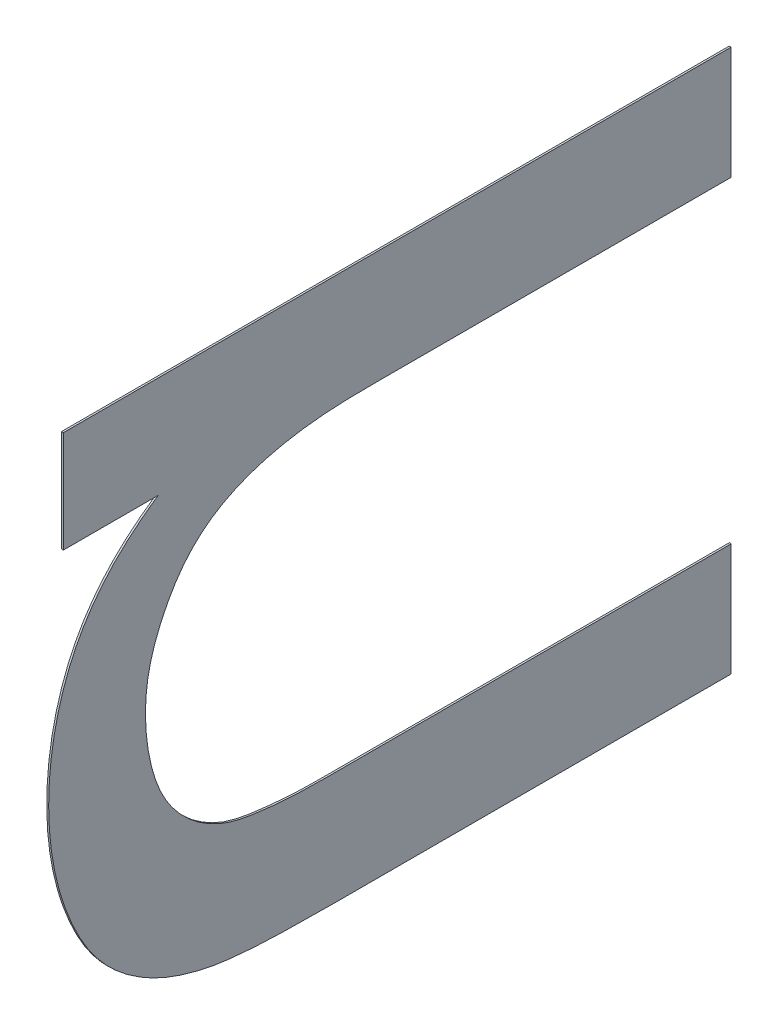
ISO-10303-21;
HEADER;
FILE_DESCRIPTION(('STEP AP214'),'2;1');
FILE_NAME('part.step','',(''),(''),'','','');
FILE_SCHEMA(('AUTOMOTIVE_DESIGN { 1 0 10303 214 1 1 1 1 }'));
ENDSEC;
DATA;
#1=APPLICATION_CONTEXT('core data for automotive mechanical design processes');
#2=APPLICATION_PROTOCOL_DEFINITION('international standard','automotive_design',2000,#1);
#3=PRODUCT_CONTEXT('',#1,'mechanical');
#4=PRODUCT('Part','Part','',(#3));
#5=PRODUCT_RELATED_PRODUCT_CATEGORY('part','',(#4));
#6=PRODUCT_DEFINITION_FORMATION('','',#4);
#7=PRODUCT_DEFINITION_CONTEXT('part definition',#1,'design');
#8=PRODUCT_DEFINITION('design','',#6,#7);
#9=PRODUCT_DEFINITION_SHAPE('','',#8);
#10=(LENGTH_UNIT() NAMED_UNIT(*) SI_UNIT(.MILLI.,.METRE.));
#11=(NAMED_UNIT(*) PLANE_ANGLE_UNIT() SI_UNIT($,.RADIAN.));
#12=(NAMED_UNIT(*) SI_UNIT($,.STERADIAN.) SOLID_ANGLE_UNIT());
#13=UNCERTAINTY_MEASURE_WITH_UNIT(LENGTH_MEASURE(1.E-05),#10,'distance_accuracy_value','');
#14=(GEOMETRIC_REPRESENTATION_CONTEXT(3) GLOBAL_UNCERTAINTY_ASSIGNED_CONTEXT((#13)) GLOBAL_UNIT_ASSIGNED_CONTEXT((#10,
#11,#12)) REPRESENTATION_CONTEXT('',''));
#15=CARTESIAN_POINT('',(0.,0.,0.));
#16=DIRECTION('',(0.,0.,1.));
#17=DIRECTION('',(1.,0.,0.));
#18=AXIS2_PLACEMENT_3D('',#15,#16,#17);
#19=CARTESIAN_POINT('',(-5.56,-14.45127010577,20.008744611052));
#20=DIRECTION('',(-1.,0.,0.));
#21=DIRECTION('',(0.,-1.,0.));
#22=AXIS2_PLACEMENT_3D('',#19,#20,#21);
#23=PLANE('',#22);
#24=DIRECTION('',(0.,1.,0.));
#25=VECTOR('',#24,1.);
#26=CARTESIAN_POINT('',(-5.56,-11.65675241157,20.699035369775));
#27=LINE('',#26,#25);
#28=CARTESIAN_POINT('',(-5.56,-11.65675241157,20.699035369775));
#29=VERTEX_POINT('',#28);
#30=CARTESIAN_POINT('',(-5.56,-12.19051446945,20.699035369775));
#31=VERTEX_POINT('',#30);
#32=EDGE_CURVE('E114',#29,#31,#27,.F.);
#33=ORIENTED_EDGE('',*,*,#32,.F.);
#34=DIRECTION('',(0.,0.,1.));
#35=VECTOR('',#34,1.);
#36=CARTESIAN_POINT('',(-5.56,-11.65675241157,17.19421221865));
#37=LINE('',#36,#35);
#38=CARTESIAN_POINT('',(-5.56,-11.65675241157,17.19421221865));
#39=VERTEX_POINT('',#38);
#40=EDGE_CURVE('E108',#39,#29,#37,.T.);
#41=ORIENTED_EDGE('',*,*,#40,.F.);
#42=DIRECTION('',(0.,-1.,0.));
#43=VECTOR('',#42,1.);
#44=CARTESIAN_POINT('',(-5.56,-14.45127010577,17.19421221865));
#45=LINE('',#44,#43);
#46=CARTESIAN_POINT('',(-5.56,-12.24839228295,17.19421221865));
#47=VERTEX_POINT('',#46);
#48=EDGE_CURVE('E96',#39,#47,#45,.T.);
#49=ORIENTED_EDGE('',*,*,#48,.T.);
#50=CARTESIAN_POINT('',(-5.56,-13.91398713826,17.19421221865));
#51=CARTESIAN_POINT('',(-5.56,-13.9139871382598,17.2008788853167));
#52=CARTESIAN_POINT('',(-5.56,-13.9139871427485,17.2075455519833));
#53=CARTESIAN_POINT('',(-5.56,-13.9139871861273,17.2408788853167));
#54=CARTESIAN_POINT('',(-5.56,-13.9139872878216,17.2675455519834));
#55=CARTESIAN_POINT('',(-5.56,-13.9139877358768,17.3475455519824));
#56=CARTESIAN_POINT('',(-5.56,-13.9139882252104,17.4008788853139));
#57=CARTESIAN_POINT('',(-5.56,-13.9139890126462,17.4808788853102));
#58=CARTESIAN_POINT('',(-5.56,-13.9139892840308,17.5075455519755));
#59=CARTESIAN_POINT('',(-5.56,-13.91398980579,17.5608788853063));
#60=CARTESIAN_POINT('',(-5.56,-13.9139900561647,17.5875455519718));
#61=CARTESIAN_POINT('',(-5.56,-13.9139904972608,17.6408788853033));
#62=CARTESIAN_POINT('',(-5.56,-13.9139906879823,17.6675455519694));
#63=CARTESIAN_POINT('',(-5.56,-13.9139909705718,17.7208788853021));
#64=CARTESIAN_POINT('',(-5.56,-13.9139910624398,17.7475455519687));
#65=CARTESIAN_POINT('',(-5.56,-13.9139911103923,17.8008788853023));
#66=CARTESIAN_POINT('',(-5.56,-13.9139910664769,17.8275455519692));
#67=CARTESIAN_POINT('',(-5.56,-13.9139907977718,17.8808788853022));
#68=CARTESIAN_POINT('',(-5.56,-13.9139905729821,17.9075455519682));
#69=CARTESIAN_POINT('',(-5.56,-13.9139899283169,17.9608788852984));
#70=CARTESIAN_POINT('',(-5.56,-13.9139895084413,17.9875455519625));
#71=CARTESIAN_POINT('',(-5.56,-13.9139877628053,18.0675455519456));
#72=CARTESIAN_POINT('',(-5.56,-13.9139859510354,18.1208788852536));
#73=CARTESIAN_POINT('',(-5.56,-13.9139832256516,18.2008788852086));
#74=CARTESIAN_POINT('',(-5.56,-13.9139823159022,18.2275455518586));
#75=CARTESIAN_POINT('',(-5.56,-13.9139801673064,18.3075455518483));
#76=CARTESIAN_POINT('',(-5.56,-13.9139795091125,18.3608788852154));
#77=CARTESIAN_POINT('',(-5.56,-13.9139813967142,18.4408788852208));
#78=CARTESIAN_POINT('',(-5.56,-13.9139825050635,18.4675455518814));
#79=CARTESIAN_POINT('',(-5.56,-13.9139861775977,18.5208788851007));
#80=CARTESIAN_POINT('',(-5.56,-13.9139887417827,18.5475455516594));
#81=CARTESIAN_POINT('',(-5.56,-13.9139976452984,18.6275455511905));
#82=CARTESIAN_POINT('',(-5.56,-13.91400519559,18.6808788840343));
#83=CARTESIAN_POINT('',(-5.56,-13.9140113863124,18.7608788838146));
#84=CARTESIAN_POINT('',(-5.56,-13.9140125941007,18.7875455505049));
#85=CARTESIAN_POINT('',(-5.56,-13.9140111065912,18.8675455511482));
#86=CARTESIAN_POINT('',(-5.56,-13.914003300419,18.9208788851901));
#87=CARTESIAN_POINT('',(-5.56,-13.9139794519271,19.0008788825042));
#88=CARTESIAN_POINT('',(-5.56,-13.9139694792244,19.027545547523));
#89=CARTESIAN_POINT('',(-5.56,-13.9139495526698,19.0808788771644));
#90=CARTESIAN_POINT('',(-5.56,-13.9139395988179,19.1075455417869));
#91=CARTESIAN_POINT('',(-5.56,-13.9139766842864,19.1875455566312));
#92=CARTESIAN_POINT('',(-5.56,-13.9140906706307,19.2408789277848));
#93=CARTESIAN_POINT('',(-5.56,-13.9139790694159,19.320879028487));
#94=CARTESIAN_POINT('',(-5.56,-13.9138947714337,19.3475458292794));
#95=CARTESIAN_POINT('',(-5.56,-13.9132873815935,19.4008942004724));
#96=CARTESIAN_POINT('',(-5.56,-13.9127640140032,19.4275757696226));
#97=CARTESIAN_POINT('',(-5.56,-13.9107964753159,19.4809003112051));
#98=CARTESIAN_POINT('',(-5.56,-13.9093525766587,19.5075432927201));
#99=CARTESIAN_POINT('',(-5.56,-13.906506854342,19.5474516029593));
#100=CARTESIAN_POINT('',(-5.56,-13.9054452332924,19.5607425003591));
#101=CARTESIAN_POINT('',(-5.56,-13.9030899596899,19.5873103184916));
#102=CARTESIAN_POINT('',(-5.56,-13.9017962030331,19.6005872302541));
#103=CARTESIAN_POINT('',(-5.56,-13.8975796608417,19.6404102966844));
#104=CARTESIAN_POINT('',(-5.56,-13.8943237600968,19.66691890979));
#105=CARTESIAN_POINT('',(-5.56,-13.8868093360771,19.7198002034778));
#106=CARTESIAN_POINT('',(-5.56,-13.8825515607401,19.7461729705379));
#107=CARTESIAN_POINT('',(-5.56,-13.8740687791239,19.7853253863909));
#108=CARTESIAN_POINT('',(-5.56,-13.8708877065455,19.7983208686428));
#109=CARTESIAN_POINT('',(-5.56,-13.8636503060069,19.8240608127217));
#110=CARTESIAN_POINT('',(-5.56,-13.8595943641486,19.8368053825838));
#111=CARTESIAN_POINT('',(-5.56,-13.8459934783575,19.8745454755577));
#112=CARTESIAN_POINT('',(-5.56,-13.8350173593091,19.8990378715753));
#113=CARTESIAN_POINT('',(-5.56,-13.8098888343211,19.9462850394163));
#114=CARTESIAN_POINT('',(-5.56,-13.7957378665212,19.9690405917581));
#115=CARTESIAN_POINT('',(-5.56,-13.7646267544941,20.0125495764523));
#116=CARTESIAN_POINT('',(-5.56,-13.7476669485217,20.0333032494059));
#117=CARTESIAN_POINT('',(-5.56,-13.7181025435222,20.0650466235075));
#118=CARTESIAN_POINT('',(-5.56,-13.7062699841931,20.0767652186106));
#119=CARTESIAN_POINT('',(-5.56,-13.6816797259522,20.0991975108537));
#120=CARTESIAN_POINT('',(-5.56,-13.6689218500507,20.1099110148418));
#121=CARTESIAN_POINT('',(-5.56,-13.6427134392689,20.1301146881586));
#122=CARTESIAN_POINT('',(-5.56,-13.6292730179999,20.1396179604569));
#123=CARTESIAN_POINT('',(-5.56,-13.601632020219,20.157449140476));
#124=CARTESIAN_POINT('',(-5.56,-13.5874312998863,20.1657768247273));
#125=CARTESIAN_POINT('',(-5.56,-13.5438387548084,20.1889601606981));
#126=CARTESIAN_POINT('',(-5.56,-13.5134728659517,20.2020035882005));
#127=CARTESIAN_POINT('',(-5.56,-13.4660525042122,20.2189520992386));
#128=CARTESIAN_POINT('',(-5.56,-13.4494612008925,20.2242685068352));
#129=CARTESIAN_POINT('',(-5.56,-13.4160059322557,20.2339001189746));
#130=CARTESIAN_POINT('',(-5.56,-13.3991422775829,20.2382163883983));
#131=CARTESIAN_POINT('',(-5.56,-13.3482540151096,20.249795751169));
#132=CARTESIAN_POINT('',(-5.56,-13.3139153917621,20.2556951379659));
#133=CARTESIAN_POINT('',(-5.56,-13.2448553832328,20.2642045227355));
#134=CARTESIAN_POINT('',(-5.56,-13.2101340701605,20.2668151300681));
#135=CARTESIAN_POINT('',(-5.56,-13.1405773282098,20.268671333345));
#136=CARTESIAN_POINT('',(-5.56,-13.1057418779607,20.2679162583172));
#137=CARTESIAN_POINT('',(-5.56,-13.0363539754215,20.2623248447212));
#138=CARTESIAN_POINT('',(-5.56,-13.0018016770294,20.2574864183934));
#139=CARTESIAN_POINT('',(-5.56,-12.9336057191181,20.2433986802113));
#140=CARTESIAN_POINT('',(-5.56,-12.8999621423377,20.2341489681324));
#141=CARTESIAN_POINT('',(-5.56,-12.834016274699,20.2118530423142));
#142=CARTESIAN_POINT('',(-5.56,-12.8017131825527,20.1988091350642));
#143=CARTESIAN_POINT('',(-5.56,-12.754167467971,20.1773621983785));
#144=CARTESIAN_POINT('',(-5.56,-12.7384788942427,20.1699043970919));
#145=CARTESIAN_POINT('',(-5.56,-12.6919108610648,20.146412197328));
#146=CARTESIAN_POINT('',(-5.56,-12.6615653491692,20.1292732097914));
#147=CARTESIAN_POINT('',(-5.56,-12.6031457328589,20.0913851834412));
#148=CARTESIAN_POINT('',(-5.56,-12.5750734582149,20.0706332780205));
#149=CARTESIAN_POINT('',(-5.56,-12.5222147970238,20.0251988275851));
#150=CARTESIAN_POINT('',(-5.56,-12.4974309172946,20.000513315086));
#151=CARTESIAN_POINT('',(-5.56,-12.4521863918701,19.9474565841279));
#152=CARTESIAN_POINT('',(-5.56,-12.4317264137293,19.919084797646));
#153=CARTESIAN_POINT('',(-5.56,-12.3950453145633,19.8598099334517));
#154=CARTESIAN_POINT('',(-5.56,-12.3788205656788,19.8289090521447));
#155=CARTESIAN_POINT('',(-5.56,-12.350058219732,19.76549715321));
#156=CARTESIAN_POINT('',(-5.56,-12.3375179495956,19.7329873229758));
#157=CARTESIAN_POINT('',(-5.56,-12.3155358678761,19.6669773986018));
#158=CARTESIAN_POINT('',(-5.56,-12.306092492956,19.6334778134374));
#159=CARTESIAN_POINT('',(-5.56,-12.2897611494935,19.5658867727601));
#160=CARTESIAN_POINT('',(-5.56,-12.2828723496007,19.5317955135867));
#161=CARTESIAN_POINT('',(-5.56,-12.2712189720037,19.4632164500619));
#162=CARTESIAN_POINT('',(-5.56,-12.2664570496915,19.4287282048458));
#163=CARTESIAN_POINT('',(-5.56,-12.2587652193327,19.3595468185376));
#164=CARTESIAN_POINT('',(-5.56,-12.2558355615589,19.3248536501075));
#165=CARTESIAN_POINT('',(-5.56,-12.2526450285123,19.2727751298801));
#166=CARTESIAN_POINT('',(-5.56,-12.2517823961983,19.2554236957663));
#167=CARTESIAN_POINT('',(-5.56,-12.250419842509,19.2207088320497));
#168=CARTESIAN_POINT('',(-5.56,-12.2499198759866,19.2033454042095));
#169=CARTESIAN_POINT('',(-5.56,-12.2491620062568,19.1686173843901));
#170=CARTESIAN_POINT('',(-5.56,-12.248904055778,19.151252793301));
#171=CARTESIAN_POINT('',(-5.56,-12.2483495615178,19.0991569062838));
#172=CARTESIAN_POINT('',(-5.56,-12.2482723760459,19.0644235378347));
#173=CARTESIAN_POINT('',(-5.56,-12.2483152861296,19.0123248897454));
#174=CARTESIAN_POINT('',(-5.56,-12.2483560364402,18.9949590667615));
#175=CARTESIAN_POINT('',(-5.56,-12.2484165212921,18.9602273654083));
#176=CARTESIAN_POINT('',(-5.56,-12.2484362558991,18.9428614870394));
#177=CARTESIAN_POINT('',(-5.56,-12.2484672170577,18.8907638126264));
#178=CARTESIAN_POINT('',(-5.56,-12.2484502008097,18.8560320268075));
#179=CARTESIAN_POINT('',(-5.56,-12.2484116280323,18.7865684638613));
#180=CARTESIAN_POINT('',(-5.56,-12.248390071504,18.7518366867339));
#181=CARTESIAN_POINT('',(-5.56,-12.2483708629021,18.6823731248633));
#182=CARTESIAN_POINT('',(-5.56,-12.2483732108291,18.6476413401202));
#183=CARTESIAN_POINT('',(-5.56,-12.2483829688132,18.578177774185));
#184=CARTESIAN_POINT('',(-5.56,-12.2483903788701,18.5434459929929));
#185=CARTESIAN_POINT('',(-5.56,-12.2484003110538,18.4739824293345));
#186=CARTESIAN_POINT('',(-5.56,-12.2484028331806,18.4392506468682));
#187=CARTESIAN_POINT('',(-5.56,-12.2484062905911,18.3350552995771));
#188=CARTESIAN_POINT('',(-5.56,-12.2484031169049,18.2655917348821));
#189=CARTESIAN_POINT('',(-5.56,-12.2483969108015,18.1613963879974));
#190=CARTESIAN_POINT('',(-5.56,-12.2483946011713,18.1266646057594));
#191=CARTESIAN_POINT('',(-5.56,-12.2483917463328,18.0745669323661));
#192=CARTESIAN_POINT('',(-5.56,-12.2483908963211,18.0572010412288));
#193=CARTESIAN_POINT('',(-5.56,-12.2483886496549,18.0051033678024));
#194=CARTESIAN_POINT('',(-5.56,-12.2483875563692,17.9703715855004));
#195=CARTESIAN_POINT('',(-5.56,-12.2483860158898,17.9009080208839));
#196=CARTESIAN_POINT('',(-5.56,-12.2483855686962,17.8661762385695));
#197=CARTESIAN_POINT('',(-5.56,-12.2483851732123,17.796712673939));
#198=CARTESIAN_POINT('',(-5.56,-12.248385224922,17.7619808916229));
#199=CARTESIAN_POINT('',(-5.56,-12.248385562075,17.7098832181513));
#200=CARTESIAN_POINT('',(-5.56,-12.248385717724,17.6925173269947));
#201=CARTESIAN_POINT('',(-5.56,-12.2483862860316,17.6404196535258));
#202=CARTESIAN_POINT('',(-5.56,-12.2483868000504,17.6056878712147));
#203=CARTESIAN_POINT('',(-5.56,-12.248387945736,17.5362243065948));
#204=CARTESIAN_POINT('',(-5.56,-12.2483885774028,17.501492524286));
#205=CARTESIAN_POINT('',(-5.56,-12.2483894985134,17.4493948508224));
#206=CARTESIAN_POINT('',(-5.56,-12.2483898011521,17.4320289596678));
#207=CARTESIAN_POINT('',(-5.56,-12.2483913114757,17.3411794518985));
#208=CARTESIAN_POINT('',(-5.56,-12.2483922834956,17.2676958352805));
#209=CARTESIAN_POINT('',(-5.56,-12.24839228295,17.19421221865));
#210=B_SPLINE_CURVE_WITH_KNOTS('',3,(#50,#51,#52,#53,#54,#55,#56,#57,#58,#59,#60,#61,#62,#63,
#64,#65,#66,#67,#68,#69,#70,#71,#72,#73,#74,#75,#76,#77,#78,#79,#80,#81,#82,#83,#84,#85,#86,#87,
#88,#89,#90,#91,#92,#93,#94,#95,#96,#97,#98,#99,#100,#101,#102,#103,#104,#105,#106,#107,#108,
#109,#110,#111,#112,#113,#114,#115,#116,#117,#118,#119,#120,#121,#122,#123,#124,#125,#126,#127,
#128,#129,#130,#131,#132,#133,#134,#135,#136,#137,#138,#139,#140,#141,#142,#143,#144,#145,#146,
#147,#148,#149,#150,#151,#152,#153,#154,#155,#156,#157,#158,#159,#160,#161,#162,#163,#164,#165,
#166,#167,#168,#169,#170,#171,#172,#173,#174,#175,#176,#177,#178,#179,#180,#181,#182,#183,#184,
#185,#186,#187,#188,#189,#190,#191,#192,#193,#194,#195,#196,#197,#198,#199,#200,#201,#202,#203,
#204,#205,#206,#207,#208,#209),.UNSPECIFIED.,.F.,.F.,(4,2,2,2,2,2,2,2,2,2,2,2,2,2,2,2,2,2,2,2,2,
2,2,2,2,2,2,2,2,2,2,2,2,2,2,2,2,2,2,2,2,2,2,2,2,2,2,2,2,2,2,2,2,2,2,2,2,2,2,2,2,2,2,2,2,2,2,2,2,
2,2,2,2,2,2,2,2,2,2,4),(0.,0.02,0.100000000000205,0.260000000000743,0.340000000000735,
0.420000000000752,0.500000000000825,0.580000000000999,0.660000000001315,0.740000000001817,
0.820000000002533,0.98000000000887,1.06000000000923,1.22000000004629,1.30000000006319,
1.38000000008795,1.54000000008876,1.620000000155,1.78000000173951,1.86000000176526,
1.94000000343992,2.10000000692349,2.18000056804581,2.26005140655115,2.34007856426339,
2.38007699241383,2.42009340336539,2.50021600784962,2.58027898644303,2.62038873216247,
2.66048081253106,2.74069375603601,2.82087043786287,2.90103747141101,2.95094854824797,
3.00086919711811,3.05019256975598,3.09952530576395,3.19825164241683,3.25050081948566,
3.30269410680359,3.40702795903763,3.51134247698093,3.61567779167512,3.72006648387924,
3.82446464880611,3.92879948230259,3.98090871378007,4.08524365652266,4.1896617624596,
4.29415901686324,4.39867239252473,4.50309594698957,4.60744355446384,4.71173840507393,
4.81599928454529,4.92038997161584,5.02479491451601,5.07691025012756,5.12901909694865,
5.18111776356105,5.28531522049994,5.33741299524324,5.38951060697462,5.49370597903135,
5.59790132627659,5.70209667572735,5.80629202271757,5.91048736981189,6.11887806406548,
6.22307341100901,6.2751710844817,6.37936643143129,6.48356177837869,6.5877571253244,
6.6398547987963,6.74405014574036,6.84824549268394,6.90034316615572,7.12079401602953),.UNSPECIFIED.);
#211=CARTESIAN_POINT('',(-5.56,-13.91398713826,17.19421221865));
#212=VERTEX_POINT('',#211);
#213=EDGE_CURVE('E24',#212,#47,#210,.T.);
#214=ORIENTED_EDGE('',*,*,#213,.F.);
#215=DIRECTION('',(0.,1.,0.));
#216=VECTOR('',#215,1.);
#217=CARTESIAN_POINT('',(-5.56,-14.50562700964,17.19421221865));
#218=LINE('',#217,#216);
#219=CARTESIAN_POINT('',(-5.56,-14.50562700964,17.19421221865));
#220=VERTEX_POINT('',#219);
#221=EDGE_CURVE('E81',#220,#212,#218,.T.);
#222=ORIENTED_EDGE('',*,*,#221,.F.);
#223=CARTESIAN_POINT('',(-5.56,-12.19051446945,20.200643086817));
#224=CARTESIAN_POINT('',(-5.56,-12.1942338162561,20.2061756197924));
#225=CARTESIAN_POINT('',(-5.56,-12.1979855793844,20.211686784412));
#226=CARTESIAN_POINT('',(-5.56,-12.2169134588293,20.2391366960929));
#227=CARTESIAN_POINT('',(-5.56,-12.2325839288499,20.2607384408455));
#228=CARTESIAN_POINT('',(-5.56,-12.2650471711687,20.3030854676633));
#229=CARTESIAN_POINT('',(-5.56,-12.2818400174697,20.3238306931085));
#230=CARTESIAN_POINT('',(-5.56,-12.3166017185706,20.3643167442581));
#231=CARTESIAN_POINT('',(-5.56,-12.3345706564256,20.3840574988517));
#232=CARTESIAN_POINT('',(-5.56,-12.3717156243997,20.4223787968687));
#233=CARTESIAN_POINT('',(-5.56,-12.3908917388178,20.4409592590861));
#234=CARTESIAN_POINT('',(-5.56,-12.4205446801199,20.4678325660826));
#235=CARTESIAN_POINT('',(-5.56,-12.4305751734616,20.4766225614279));
#236=CARTESIAN_POINT('',(-5.56,-12.461120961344,20.502480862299));
#237=CARTESIAN_POINT('',(-5.56,-12.4820817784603,20.5190289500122));
#238=CARTESIAN_POINT('',(-5.56,-12.5251243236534,20.5506010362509));
#239=CARTESIAN_POINT('',(-5.56,-12.5472060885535,20.5656249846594));
#240=CARTESIAN_POINT('',(-5.56,-12.5810807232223,20.5869391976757));
#241=CARTESIAN_POINT('',(-5.56,-12.5924948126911,20.5938388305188));
#242=CARTESIAN_POINT('',(-5.56,-12.62711008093,20.6139284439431));
#243=CARTESIAN_POINT('',(-5.56,-12.6506738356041,20.626502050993));
#244=CARTESIAN_POINT('',(-5.56,-12.6986213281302,20.6499594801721));
#245=CARTESIAN_POINT('',(-5.56,-12.7230050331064,20.6608433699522));
#246=CARTESIAN_POINT('',(-5.56,-12.7724259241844,20.6809956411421));
#247=CARTESIAN_POINT('',(-5.56,-12.7974630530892,20.69026416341));
#248=CARTESIAN_POINT('',(-5.56,-12.84804547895,20.707276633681));
#249=CARTESIAN_POINT('',(-5.56,-12.8735907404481,20.7150206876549));
#250=CARTESIAN_POINT('',(-5.56,-12.9250737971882,20.7290565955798));
#251=CARTESIAN_POINT('',(-5.56,-12.9510115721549,20.7353485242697));
#252=CARTESIAN_POINT('',(-5.56,-13.0031843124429,20.7465406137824));
#253=CARTESIAN_POINT('',(-5.56,-13.0294192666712,20.7514408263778));
#254=CARTESIAN_POINT('',(-5.56,-13.0821004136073,20.7598936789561));
#255=CARTESIAN_POINT('',(-5.56,-13.1085466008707,20.7634463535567));
#256=CARTESIAN_POINT('',(-5.56,-13.1881654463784,20.7721414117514));
#257=CARTESIAN_POINT('',(-5.56,-13.2415718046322,20.7753110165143));
#258=CARTESIAN_POINT('',(-5.56,-13.3216589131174,20.7761734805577));
#259=CARTESIAN_POINT('',(-5.56,-13.3483387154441,20.7758133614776));
#260=CARTESIAN_POINT('',(-5.56,-13.4016532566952,20.7737872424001));
#261=CARTESIAN_POINT('',(-5.56,-13.4282879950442,20.7721212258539));
#262=CARTESIAN_POINT('',(-5.56,-13.4814375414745,20.7674186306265));
#263=CARTESIAN_POINT('',(-5.56,-13.5079523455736,20.76438200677));
#264=CARTESIAN_POINT('',(-5.56,-13.5607815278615,20.7568869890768));
#265=CARTESIAN_POINT('',(-5.56,-13.5870959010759,20.7524285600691));
#266=CARTESIAN_POINT('',(-5.56,-13.6394419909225,20.7420710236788));
#267=CARTESIAN_POINT('',(-5.56,-13.6654737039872,20.7361718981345));
#268=CARTESIAN_POINT('',(-5.56,-13.7171644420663,20.7229432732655));
#269=CARTESIAN_POINT('',(-5.56,-13.7428234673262,20.7156137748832));
#270=CARTESIAN_POINT('',(-5.56,-13.81924227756,20.6915231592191));
#271=CARTESIAN_POINT('',(-5.56,-13.8693790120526,20.6726728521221));
#272=CARTESIAN_POINT('',(-5.56,-13.9424815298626,20.6398661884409));
#273=CARTESIAN_POINT('',(-5.56,-13.9664862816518,20.6281829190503));
#274=CARTESIAN_POINT('',(-5.56,-14.0136168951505,20.6031257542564));
#275=CARTESIAN_POINT('',(-5.56,-14.0367425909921,20.5897515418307));
#276=CARTESIAN_POINT('',(-5.56,-14.0817618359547,20.561038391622));
#277=CARTESIAN_POINT('',(-5.56,-14.1036550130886,20.545698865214));
#278=CARTESIAN_POINT('',(-5.56,-14.1458803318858,20.5129938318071));
#279=CARTESIAN_POINT('',(-5.56,-14.1662122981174,20.4956280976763));
#280=CARTESIAN_POINT('',(-5.56,-14.205116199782,20.4590268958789));
#281=CARTESIAN_POINT('',(-5.56,-14.2236881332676,20.4397914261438));
#282=CARTESIAN_POINT('',(-5.56,-14.2589385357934,20.3996665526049));
#283=CARTESIAN_POINT('',(-5.56,-14.2756171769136,20.3787772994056));
#284=CARTESIAN_POINT('',(-5.56,-14.3071091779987,20.3356472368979));
#285=CARTESIAN_POINT('',(-5.56,-14.3219228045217,20.3134066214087));
#286=CARTESIAN_POINT('',(-5.56,-14.3496102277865,20.2677469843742));
#287=CARTESIAN_POINT('',(-5.56,-14.3624839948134,20.2443279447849));
#288=CARTESIAN_POINT('',(-5.56,-14.3861812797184,20.1964788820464));
#289=CARTESIAN_POINT('',(-5.56,-14.3970049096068,20.1720489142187));
#290=CARTESIAN_POINT('',(-5.56,-14.4166812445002,20.1224159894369));
#291=CARTESIAN_POINT('',(-5.56,-14.4255342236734,20.0972131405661));
#292=CARTESIAN_POINT('',(-5.56,-14.4374702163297,20.0590020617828));
#293=CARTESIAN_POINT('',(-5.56,-14.4412247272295,20.0461982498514));
#294=CARTESIAN_POINT('',(-5.56,-14.4483067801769,20.0204694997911));
#295=CARTESIAN_POINT('',(-5.56,-14.4516342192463,20.0075445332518));
#296=CARTESIAN_POINT('',(-5.56,-14.4579344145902,19.9816127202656));
#297=CARTESIAN_POINT('',(-5.56,-14.4609072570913,19.9686058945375));
#298=CARTESIAN_POINT('',(-5.56,-14.4651468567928,19.9490507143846));
#299=CARTESIAN_POINT('',(-5.56,-14.4665232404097,19.9425258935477));
#300=CARTESIAN_POINT('',(-5.56,-14.4691924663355,19.9294594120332));
#301=CARTESIAN_POINT('',(-5.56,-14.4704853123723,19.9229177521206));
#302=CARTESIAN_POINT('',(-5.56,-14.4729516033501,19.9098058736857));
#303=CARTESIAN_POINT('',(-5.56,-14.4741249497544,19.9032356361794));
#304=CARTESIAN_POINT('',(-5.56,-14.4762749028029,19.8900629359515));
#305=CARTESIAN_POINT('',(-5.56,-14.4772515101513,19.8834604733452));
#306=CARTESIAN_POINT('',(-5.56,-14.4790674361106,19.8702359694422));
#307=CARTESIAN_POINT('',(-5.56,-14.4799067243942,19.8636139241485));
#308=CARTESIAN_POINT('',(-5.56,-14.4815513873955,19.8503653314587));
#309=CARTESIAN_POINT('',(-5.56,-14.4823567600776,19.8437387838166));
#310=CARTESIAN_POINT('',(-5.56,-14.4846923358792,19.823864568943));
#311=CARTESIAN_POINT('',(-5.56,-14.4861439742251,19.8106075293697));
#312=CARTESIAN_POINT('',(-5.56,-14.4888442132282,19.7840736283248));
#313=CARTESIAN_POINT('',(-5.56,-14.4900928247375,19.7707967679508));
#314=CARTESIAN_POINT('',(-5.56,-14.4923795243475,19.7442246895));
#315=CARTESIAN_POINT('',(-5.56,-14.4934176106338,19.7309294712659));
#316=CARTESIAN_POINT('',(-5.56,-14.4952776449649,19.7043234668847));
#317=CARTESIAN_POINT('',(-5.56,-14.4960995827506,19.6910126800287));
#318=CARTESIAN_POINT('',(-5.56,-14.4983261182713,19.6510671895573));
#319=CARTESIAN_POINT('',(-5.56,-14.4994914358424,19.6244193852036));
#320=CARTESIAN_POINT('',(-5.56,-14.5014242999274,19.5711096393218));
#321=CARTESIAN_POINT('',(-5.56,-14.5021918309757,19.5444476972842));
#322=CARTESIAN_POINT('',(-5.56,-14.5034504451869,19.4911229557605));
#323=CARTESIAN_POINT('',(-5.56,-14.5039415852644,19.4644601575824));
#324=CARTESIAN_POINT('',(-5.56,-14.5047271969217,19.4111320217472));
#325=CARTESIAN_POINT('',(-5.56,-14.5050216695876,19.384466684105));
#326=CARTESIAN_POINT('',(-5.56,-14.5054792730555,19.3311350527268));
#327=CARTESIAN_POINT('',(-5.56,-14.505642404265,19.304468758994));
#328=CARTESIAN_POINT('',(-5.56,-14.5058813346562,19.2511358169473));
#329=CARTESIAN_POINT('',(-5.56,-14.5059571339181,19.2244691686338));
#330=CARTESIAN_POINT('',(-5.56,-14.5060563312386,19.144469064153));
#331=CARTESIAN_POINT('',(-5.56,-14.5059515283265,19.0911355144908));
#332=CARTESIAN_POINT('',(-5.56,-14.5057582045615,19.0111355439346));
#333=CARTESIAN_POINT('',(-5.56,-14.5056877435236,18.9844689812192));
#334=CARTESIAN_POINT('',(-5.56,-14.5055858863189,18.9311357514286));
#335=CARTESIAN_POINT('',(-5.56,-14.5055544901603,18.9044690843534));
#336=CARTESIAN_POINT('',(-5.56,-14.5055189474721,18.8511357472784));
#337=CARTESIAN_POINT('',(-5.56,-14.505514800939,18.8244690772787));
#338=CARTESIAN_POINT('',(-5.56,-14.5055227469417,18.7711357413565));
#339=CARTESIAN_POINT('',(-5.56,-14.5055348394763,18.7444690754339));
#340=CARTESIAN_POINT('',(-5.56,-14.505566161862,18.6911357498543));
#341=CARTESIAN_POINT('',(-5.56,-14.5055853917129,18.6644690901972));
#342=CARTESIAN_POINT('',(-5.56,-14.5056209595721,18.6111357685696));
#343=CARTESIAN_POINT('',(-5.56,-14.5056372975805,18.584469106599));
#344=CARTESIAN_POINT('',(-5.56,-14.5056634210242,18.5311357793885));
#345=CARTESIAN_POINT('',(-5.56,-14.5056732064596,18.5044691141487));
#346=CARTESIAN_POINT('',(-5.56,-14.5056880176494,18.4511357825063));
#347=CARTESIAN_POINT('',(-5.56,-14.5056930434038,18.4244691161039));
#348=CARTESIAN_POINT('',(-5.56,-14.5056989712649,18.3711357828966));
#349=CARTESIAN_POINT('',(-5.56,-14.5056998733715,18.3444691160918));
#350=CARTESIAN_POINT('',(-5.56,-14.5056985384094,18.2911357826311));
#351=CARTESIAN_POINT('',(-5.56,-14.5056963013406,18.2644691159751));
#352=CARTESIAN_POINT('',(-5.56,-14.5056862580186,18.1844691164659));
#353=CARTESIAN_POINT('',(-5.56,-14.50567511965,18.1311357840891));
#354=CARTESIAN_POINT('',(-5.56,-14.5056575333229,18.0511357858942));
#355=CARTESIAN_POINT('',(-5.56,-14.5056515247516,18.0244691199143));
#356=CARTESIAN_POINT('',(-5.56,-14.5056401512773,17.9711357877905));
#357=CARTESIAN_POINT('',(-5.56,-14.5056347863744,17.9444691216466));
#358=CARTESIAN_POINT('',(-5.56,-14.5056257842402,17.8911357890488));
#359=CARTESIAN_POINT('',(-5.56,-14.505622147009,17.864469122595));
#360=CARTESIAN_POINT('',(-5.56,-14.505616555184,17.8111357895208));
#361=CARTESIAN_POINT('',(-5.56,-14.5056146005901,17.7844691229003));
#362=CARTESIAN_POINT('',(-5.56,-14.5056126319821,17.7444691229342));
#363=CARTESIAN_POINT('',(-5.56,-14.5056121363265,17.7311357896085));
#364=CARTESIAN_POINT('',(-5.56,-14.5056110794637,17.6911357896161));
#365=CARTESIAN_POINT('',(-5.56,-14.5056109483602,17.6644691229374));
#366=CARTESIAN_POINT('',(-5.56,-14.5056115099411,17.6111357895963));
#367=CARTESIAN_POINT('',(-5.56,-14.5056122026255,17.584469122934));
#368=CARTESIAN_POINT('',(-5.56,-14.5056140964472,17.5311357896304));
#369=CARTESIAN_POINT('',(-5.56,-14.5056152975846,17.5044691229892));
#370=CARTESIAN_POINT('',(-5.56,-14.5056172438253,17.4644691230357));
#371=CARTESIAN_POINT('',(-5.56,-14.5056179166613,17.4511357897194));
#372=CARTESIAN_POINT('',(-5.56,-14.5056199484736,17.4111357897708));
#373=CARTESIAN_POINT('',(-5.56,-14.505621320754,17.3844691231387));
#374=CARTESIAN_POINT('',(-5.56,-14.5056250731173,17.3032723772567));
#375=CARTESIAN_POINT('',(-5.56000000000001,-14.5056270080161,17.2487422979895));
#376=CARTESIAN_POINT('',(-5.56,-14.50562700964,17.19421221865));
#377=B_SPLINE_CURVE_WITH_KNOTS('',3,(#223,#224,#225,#226,#227,#228,#229,#230,#231,#232,#233,
#234,#235,#236,#237,#238,#239,#240,#241,#242,#243,#244,#245,#246,#247,#248,#249,#250,#251,#252,
#253,#254,#255,#256,#257,#258,#259,#260,#261,#262,#263,#264,#265,#266,#267,#268,#269,#270,#271,
#272,#273,#274,#275,#276,#277,#278,#279,#280,#281,#282,#283,#284,#285,#286,#287,#288,#289,#290,
#291,#292,#293,#294,#295,#296,#297,#298,#299,#300,#301,#302,#303,#304,#305,#306,#307,#308,#309,
#310,#311,#312,#313,#314,#315,#316,#317,#318,#319,#320,#321,#322,#323,#324,#325,#326,#327,#328,
#329,#330,#331,#332,#333,#334,#335,#336,#337,#338,#339,#340,#341,#342,#343,#344,#345,#346,#347,
#348,#349,#350,#351,#352,#353,#354,#355,#356,#357,#358,#359,#360,#361,#362,#363,#364,#365,#366,
#367,#368,#369,#370,#371,#372,#373,#374,#375,#376),.UNSPECIFIED.,.F.,.F.,(4,2,2,2,2,2,2,2,2,2,2,
2,2,2,2,2,2,2,2,2,2,2,2,2,2,2,2,2,2,2,2,2,2,2,2,2,2,2,2,2,2,2,2,2,2,2,2,2,2,2,2,2,2,2,2,2,2,2,2,
2,2,2,2,2,2,2,2,2,2,2,2,2,2,2,2,2,4),(0.,0.0200003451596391,0.100024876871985,0.180054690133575,
0.260090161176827,0.340131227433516,0.380136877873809,0.460184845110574,0.540235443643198,
0.580241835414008,0.660292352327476,0.740339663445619,0.820379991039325,0.900414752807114,
0.980445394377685,1.06047305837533,1.14049866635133,1.30069209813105,1.38071585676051,
1.46074062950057,1.54076804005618,1.62079743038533,1.70082782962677,1.78085817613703,
1.94111615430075,2.02115924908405,2.10121737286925,2.18129953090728,2.26139067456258,
2.3414819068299,2.42156585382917,2.50163834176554,2.58171205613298,2.6617813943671,
2.74183958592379,2.78186243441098,2.82189491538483,2.86191764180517,2.88192251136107,
2.90192648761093,2.92194682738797,2.94196709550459,2.96199177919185,2.98201766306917,
3.02202463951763,3.06202947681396,3.10203465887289,3.14204173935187,3.2220559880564,
3.30207334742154,3.38207422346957,3.46207465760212,3.54207484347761,3.62207495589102,
3.78207537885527,3.86207537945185,3.94207539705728,4.02207540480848,4.10207540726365,
4.18207540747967,4.26207540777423,4.34207540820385,4.42207540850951,4.50207540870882,
4.58207540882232,4.74207540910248,4.82207540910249,4.90207540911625,4.98207540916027,
5.06207540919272,5.10207540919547,5.18207540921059,5.26207540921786,5.34207540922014,
5.38207540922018,5.46207540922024,5.62566564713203),.UNSPECIFIED.);
#378=CARTESIAN_POINT('',(-5.56,-12.19051446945,20.200643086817));
#379=VERTEX_POINT('',#378);
#380=EDGE_CURVE('E103',#379,#220,#377,.T.);
#381=ORIENTED_EDGE('',*,*,#380,.F.);
#382=DIRECTION('',(0.,0.,1.));
#383=VECTOR('',#382,1.);
#384=CARTESIAN_POINT('',(-5.56,-12.19051446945,20.699035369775));
#385=LINE('',#384,#383);
#386=EDGE_CURVE('E122',#31,#379,#385,.F.);
#387=ORIENTED_EDGE('',*,*,#386,.F.);
#388=EDGE_LOOP('',(#33,#41,#49,#214,#222,#381,#387));
#389=FACE_BOUND('',#388,.T.);
#390=ADVANCED_FACE('F17',(#389),#23,.T.);
#391=CARTESIAN_POINT('',(-5.56,-13.91398713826,17.19421221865));
#392=CARTESIAN_POINT('',(-5.55,-13.91398713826,17.19421221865));
#393=CARTESIAN_POINT('',(-5.56,-13.91398713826,17.491014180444));
#394=CARTESIAN_POINT('',(-5.55,-13.91398713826,17.491014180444));
#395=CARTESIAN_POINT('',(-5.56,-13.91400048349,17.935651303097));
#396=CARTESIAN_POINT('',(-5.55,-13.91400048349,17.935651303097));
#397=CARTESIAN_POINT('',(-5.56,-13.91396489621,18.530764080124));
#398=CARTESIAN_POINT('',(-5.55,-13.91396489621,18.530764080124));
#399=CARTESIAN_POINT('',(-5.56,-13.91405386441,18.897994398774));
#400=CARTESIAN_POINT('',(-5.55,-13.91405386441,18.897994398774));
#401=CARTESIAN_POINT('',(-5.56,-13.91389427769,19.164462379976));
#402=CARTESIAN_POINT('',(-5.55,-13.91389427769,19.164462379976));
#403=CARTESIAN_POINT('',(-5.56,-13.91415006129,19.302018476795));
#404=CARTESIAN_POINT('',(-5.55,-13.91415006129,19.302018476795));
#405=CARTESIAN_POINT('',(-5.56,-13.91310246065,19.494836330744));
#406=CARTESIAN_POINT('',(-5.55,-13.91310246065,19.494836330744));
#407=CARTESIAN_POINT('',(-5.56,-13.89344062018,19.694785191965));
#408=CARTESIAN_POINT('',(-5.55,-13.89344062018,19.694785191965));
#409=CARTESIAN_POINT('',(-5.56,-13.85085064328,19.91788688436));
#410=CARTESIAN_POINT('',(-5.55,-13.85085064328,19.91788688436));
#411=CARTESIAN_POINT('',(-5.56,-13.62283315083,20.213935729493));
#412=CARTESIAN_POINT('',(-5.55,-13.62283315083,20.213935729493));
#413=CARTESIAN_POINT('',(-5.56,-13.10234830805,20.29802089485));
#414=CARTESIAN_POINT('',(-5.55,-13.10234830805,20.29802089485));
#415=CARTESIAN_POINT('',(-5.56,-12.76862679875,20.202102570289));
#416=CARTESIAN_POINT('',(-5.55,-12.76862679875,20.202102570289));
#417=CARTESIAN_POINT('',(-5.56,-12.44314701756,20.000593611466));
#418=CARTESIAN_POINT('',(-5.55,-12.44314701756,20.000593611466));
#419=CARTESIAN_POINT('',(-5.56,-12.29056290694,19.652240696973));
#420=CARTESIAN_POINT('',(-5.55,-12.29056290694,19.652240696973));
#421=CARTESIAN_POINT('',(-5.56,-12.24996421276,19.30220123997));
#422=CARTESIAN_POINT('',(-5.55,-12.24996421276,19.30220123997));
#423=CARTESIAN_POINT('',(-5.56,-12.24810243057,19.072978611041));
#424=CARTESIAN_POINT('',(-5.55,-12.24810243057,19.072978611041));
#425=CARTESIAN_POINT('',(-5.56,-12.24855946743,18.944491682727));
#426=CARTESIAN_POINT('',(-5.55,-12.24855946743,18.944491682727));
#427=CARTESIAN_POINT('',(-5.56,-12.24833688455,18.749394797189));
#428=CARTESIAN_POINT('',(-5.55,-12.24833688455,18.749394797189));
#429=CARTESIAN_POINT('',(-5.56,-12.24842393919,18.456493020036));
#430=CARTESIAN_POINT('',(-5.55,-12.24842393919,18.456493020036));
#431=CARTESIAN_POINT('',(-5.56,-12.24836854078,17.934889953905));
#432=CARTESIAN_POINT('',(-5.55,-12.24836854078,17.934889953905));
#433=CARTESIAN_POINT('',(-5.56,-12.24839228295,17.490895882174));
#434=CARTESIAN_POINT('',(-5.55,-12.24839228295,17.490895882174));
#435=CARTESIAN_POINT('',(-5.56,-12.24839228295,17.19421221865));
#436=CARTESIAN_POINT('',(-5.55,-12.24839228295,17.19421221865));
#437=B_SPLINE_SURFACE_WITH_KNOTS('',3,1,((#391,#392),(#393,#394),(#395,#396),(#397,#398),(#399,
#400),(#401,#402),(#403,#404),(#405,#406),(#407,#408),(#409,#410),(#411,#412),(#413,#414),(#415,
#416),(#417,#418),(#419,#420),(#421,#422),(#423,#424),(#425,#426),(#427,#428),(#429,#430),(#431,
#432),(#433,#434),(#435,#436)),.UNSPECIFIED.,.F.,.F.,.F.,(4,1,1,1,1,1,1,1,1,1,1,1,1,1,1,1,1,1,1,
1,4),(2,2),(0.582301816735,0.630510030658,0.65461413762,0.678718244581,0.690770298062,
0.696796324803,0.702822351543,0.714874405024,0.726926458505,0.751030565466,0.775134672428,
0.799238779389,0.823342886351,0.847446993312,0.859499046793,0.865525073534,0.871551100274,
0.883603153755,0.895655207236,0.919759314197,0.96796752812),(0.,1.),.UNSPECIFIED.);
#438=DIRECTION('',(-1.,0.,0.));
#439=VECTOR('',#438,1.);
#440=CARTESIAN_POINT('',(-5.56,-12.24839228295,17.19421221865));
#441=LINE('',#440,#439);
#442=CARTESIAN_POINT('',(-5.55,-12.24839228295,17.19421221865));
#443=VERTEX_POINT('',#442);
#444=EDGE_CURVE('E267',#443,#47,#441,.T.);
#445=CARTESIAN_POINT('',(-5.55,-12.24839228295,17.19421221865));
#446=CARTESIAN_POINT('',(-5.55,-12.2483922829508,17.2008788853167));
#447=CARTESIAN_POINT('',(-5.55,-12.2483922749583,17.2075455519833));
#448=CARTESIAN_POINT('',(-5.55,-12.2483921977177,17.2408788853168));
#449=CARTESIAN_POINT('',(-5.55,-12.248392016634,17.2675455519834));
#450=CARTESIAN_POINT('',(-5.55,-12.2483912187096,17.3475455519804));
#451=CARTESIAN_POINT('',(-5.55,-12.2483903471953,17.4008788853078));
#452=CARTESIAN_POINT('',(-5.55,-12.2483889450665,17.4808788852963));
#453=CARTESIAN_POINT('',(-5.55,-12.2483884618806,17.5075455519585));
#454=CARTESIAN_POINT('',(-5.55,-12.2483875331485,17.5608788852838));
#455=CARTESIAN_POINT('',(-5.55,-12.2483870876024,17.5875455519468));
#456=CARTESIAN_POINT('',(-5.55,-12.2483863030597,17.6408788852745));
#457=CARTESIAN_POINT('',(-5.55,-12.2483859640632,17.6675455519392));
#458=CARTESIAN_POINT('',(-5.55,-12.248385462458,17.7208788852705));
#459=CARTESIAN_POINT('',(-5.55,-12.2483852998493,17.7475455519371));
#460=CARTESIAN_POINT('',(-5.55,-12.2483852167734,17.8008788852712));
#461=CARTESIAN_POINT('',(-5.55,-12.2483852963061,17.8275455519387));
#462=CARTESIAN_POINT('',(-5.55,-12.2483857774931,17.8808788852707));
#463=CARTESIAN_POINT('',(-5.55,-12.2483861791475,17.9075455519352));
#464=CARTESIAN_POINT('',(-5.55,-12.2483873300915,17.9608788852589));
#465=CARTESIAN_POINT('',(-5.55,-12.2483880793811,17.987545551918));
#466=CARTESIAN_POINT('',(-5.55,-12.2483911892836,18.0675455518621));
#467=CARTESIAN_POINT('',(-5.55,-12.2483944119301,18.1208788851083));
#468=CARTESIAN_POINT('',(-5.55,-12.2483992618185,18.2008788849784));
#469=CARTESIAN_POINT('',(-5.55,-12.2484008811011,18.2275455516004));
#470=CARTESIAN_POINT('',(-5.55,-12.2484046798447,18.307545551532));
#471=CARTESIAN_POINT('',(-5.55,-12.2484058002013,18.3608788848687));
#472=CARTESIAN_POINT('',(-5.55,-12.2484025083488,18.4408788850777));
#473=CARTESIAN_POINT('',(-5.55,-12.2484005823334,18.4675455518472));
#474=CARTESIAN_POINT('',(-5.55,-12.2483938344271,18.5208788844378));
#475=CARTESIAN_POINT('',(-5.55,-12.2483890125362,18.5475455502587));
#476=CARTESIAN_POINT('',(-5.55,-12.2483750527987,18.6275455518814));
#477=CARTESIAN_POINT('',(-5.55,-12.2483664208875,18.6808788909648));
#478=CARTESIAN_POINT('',(-5.55,-12.248394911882,18.7608788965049));
#479=CARTESIAN_POINT('',(-5.55,-12.2484113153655,18.7875455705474));
#480=CARTESIAN_POINT('',(-5.55,-12.248442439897,18.840878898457));
#481=CARTESIAN_POINT('',(-5.55,-12.2484571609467,18.8675455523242));
#482=CARTESIAN_POINT('',(-5.55,-12.248452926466,18.9208788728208));
#483=CARTESIAN_POINT('',(-5.55,-12.248433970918,18.9475455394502));
#484=CARTESIAN_POINT('',(-5.55,-12.2483509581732,19.0008788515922));
#485=CARTESIAN_POINT('',(-5.55,-12.2482869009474,19.0275454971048));
#486=CARTESIAN_POINT('',(-5.55,-12.2483323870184,19.0808790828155));
#487=CARTESIAN_POINT('',(-5.55,-12.2484419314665,19.1075460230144));
#488=CARTESIAN_POINT('',(-5.55,-12.2490032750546,19.1608783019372));
#489=CARTESIAN_POINT('',(-5.55,-12.2494550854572,19.1875436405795));
#490=CARTESIAN_POINT('',(-5.55,-12.2510959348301,19.2408727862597));
#491=CARTESIAN_POINT('',(-5.55,-12.2522854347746,19.2675365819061));
#492=CARTESIAN_POINT('',(-5.55,-12.255633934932,19.3208025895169));
#493=CARTESIAN_POINT('',(-5.55,-12.2577930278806,19.3474047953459));
#494=CARTESIAN_POINT('',(-5.55,-12.2658340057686,19.4270906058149));
#495=CARTESIAN_POINT('',(-5.55,-12.2732793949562,19.4800446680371));
#496=CARTESIAN_POINT('',(-5.55,-12.288425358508,19.558660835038));
#497=CARTESIAN_POINT('',(-5.55,-12.2941348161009,19.5847231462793));
#498=CARTESIAN_POINT('',(-5.55,-12.3136027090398,19.6624972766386));
#499=CARTESIAN_POINT('',(-5.55,-12.3296880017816,19.7136970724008));
#500=CARTESIAN_POINT('',(-5.55,-12.3599041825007,19.7879645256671));
#501=CARTESIAN_POINT('',(-5.55,-12.3709819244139,19.8122835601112));
#502=CARTESIAN_POINT('',(-5.55,-12.3954451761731,19.8597660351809));
#503=CARTESIAN_POINT('',(-5.55,-12.4088314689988,19.8829290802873));
#504=CARTESIAN_POINT('',(-5.55,-12.4336734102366,19.9208822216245));
#505=CARTESIAN_POINT('',(-5.55,-12.4444925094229,19.936089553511));
#506=CARTESIAN_POINT('',(-5.55,-12.4673811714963,19.9655321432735));
#507=CARTESIAN_POINT('',(-5.55,-12.4794507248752,19.9797674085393));
#508=CARTESIAN_POINT('',(-5.55,-12.5174090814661,20.020837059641));
#509=CARTESIAN_POINT('',(-5.55,-12.5450656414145,20.0460630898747));
#510=CARTESIAN_POINT('',(-5.55,-12.6037485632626,20.092041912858));
#511=CARTESIAN_POINT('',(-5.55,-12.6347718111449,20.112798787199));
#512=CARTESIAN_POINT('',(-5.55,-12.6990080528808,20.1504256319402));
#513=CARTESIAN_POINT('',(-5.55,-12.7322188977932,20.1672993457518));
#514=CARTESIAN_POINT('',(-5.55,-12.7829622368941,20.1904195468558));
#515=CARTESIAN_POINT('',(-5.55,-12.8000206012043,20.1977574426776));
#516=CARTESIAN_POINT('',(-5.55,-12.8518269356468,20.2184297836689));
#517=CARTESIAN_POINT('',(-5.55,-12.8871587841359,20.2303978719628));
#518=CARTESIAN_POINT('',(-5.55,-12.9410748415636,20.2446999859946));
#519=CARTESIAN_POINT('',(-5.55,-12.9591893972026,20.248857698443));
#520=CARTESIAN_POINT('',(-5.55,-13.0139720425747,20.2594674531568));
#521=CARTESIAN_POINT('',(-5.55,-13.0510208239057,20.2640362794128));
#522=CARTESIAN_POINT('',(-5.55,-13.125329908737,20.2686305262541));
#523=CARTESIAN_POINT('',(-5.55,-13.1625900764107,20.2686585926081));
#524=CARTESIAN_POINT('',(-5.55,-13.2368988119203,20.2649702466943));
#525=CARTESIAN_POINT('',(-5.55,-13.2739474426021,20.2612550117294));
#526=CARTESIAN_POINT('',(-5.55,-13.3474949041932,20.2499872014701));
#527=CARTESIAN_POINT('',(-5.55,-13.3839936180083,20.2424338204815));
#528=CARTESIAN_POINT('',(-5.55,-13.4378578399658,20.227793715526));
#529=CARTESIAN_POINT('',(-5.55,-13.4556777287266,20.2223569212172));
#530=CARTESIAN_POINT('',(-5.55,-13.4908970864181,20.210250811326));
#531=CARTESIAN_POINT('',(-5.55,-13.5082966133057,20.2035816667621));
#532=CARTESIAN_POINT('',(-5.55,-13.5409044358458,20.1895602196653));
#533=CARTESIAN_POINT('',(-5.55,-13.5561650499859,20.1823309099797));
#534=CARTESIAN_POINT('',(-5.55,-13.5860089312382,20.1665968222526));
#535=CARTESIAN_POINT('',(-5.55,-13.6005923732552,20.1580923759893));
#536=CARTESIAN_POINT('',(-5.55,-13.6425716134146,20.1310914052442));
#537=CARTESIAN_POINT('',(-5.55,-13.6688563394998,20.1108280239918));
#538=CARTESIAN_POINT('',(-5.55,-13.7177657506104,20.0663440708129));
#539=CARTESIAN_POINT('',(-5.55,-13.7403913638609,20.0421245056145));
#540=CARTESIAN_POINT('',(-5.55,-13.7815467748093,19.9903959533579));
#541=CARTESIAN_POINT('',(-5.55,-13.8000767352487,19.9628870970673));
#542=CARTESIAN_POINT('',(-5.55,-13.823865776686,19.9204299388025));
#543=CARTESIAN_POINT('',(-5.55,-13.8309757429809,19.9064931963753));
#544=CARTESIAN_POINT('',(-5.55,-13.8440166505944,19.8780860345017));
#545=CARTESIAN_POINT('',(-5.55,-13.8499486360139,19.8636161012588));
#546=CARTESIAN_POINT('',(-5.55,-13.8605109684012,19.8342148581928));
#547=CARTESIAN_POINT('',(-5.55,-13.8651416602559,19.819283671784));
#548=CARTESIAN_POINT('',(-5.55,-13.8732405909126,19.7891014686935));
#549=CARTESIAN_POINT('',(-5.55,-13.876707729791,19.7738501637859));
#550=CARTESIAN_POINT('',(-5.55,-13.8827811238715,19.7432209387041));
#551=CARTESIAN_POINT('',(-5.55,-13.8853893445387,19.7278433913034));
#552=CARTESIAN_POINT('',(-5.55,-13.8901299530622,19.6970134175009));
#553=CARTESIAN_POINT('',(-5.55,-13.8922621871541,19.6815609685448));
#554=CARTESIAN_POINT('',(-5.55,-13.8962409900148,19.6506150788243));
#555=CARTESIAN_POINT('',(-5.55,-13.8980874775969,19.6351216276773));
#556=CARTESIAN_POINT('',(-5.55,-13.9014596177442,19.6041026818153));
#557=CARTESIAN_POINT('',(-5.55,-13.9029853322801,19.5885771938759));
#558=CARTESIAN_POINT('',(-5.55,-13.9057218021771,19.5575306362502));
#559=CARTESIAN_POINT('',(-5.55,-13.9069331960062,19.5420096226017));
#560=CARTESIAN_POINT('',(-5.55,-13.9090455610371,19.5109524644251));
#561=CARTESIAN_POINT('',(-5.55,-13.9099466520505,19.4954163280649));
#562=CARTESIAN_POINT('',(-5.55,-13.9114346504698,19.4643270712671));
#563=CARTESIAN_POINT('',(-5.55,-13.9120215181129,19.4487739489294));
#564=CARTESIAN_POINT('',(-5.55,-13.9129113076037,19.4176592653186));
#565=CARTESIAN_POINT('',(-5.55,-13.9132142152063,19.4020977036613));
#566=CARTESIAN_POINT('',(-5.55,-13.9138741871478,19.3554149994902));
#567=CARTESIAN_POINT('',(-5.55,-13.913982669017,19.3242910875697));
#568=CARTESIAN_POINT('',(-5.55,-13.9140530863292,19.2620451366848));
#569=CARTESIAN_POINT('',(-5.55,-13.9140150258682,19.2309230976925));
#570=CARTESIAN_POINT('',(-5.55,-13.9139636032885,19.1686804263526));
#571=CARTESIAN_POINT('',(-5.55,-13.9139502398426,19.1375597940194));
#572=CARTESIAN_POINT('',(-5.55,-13.9139495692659,19.0753186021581));
#573=CARTESIAN_POINT('',(-5.55,-13.9139622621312,19.04419804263));
#574=CARTESIAN_POINT('',(-5.55,-13.9139850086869,18.9819569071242));
#575=CARTESIAN_POINT('',(-5.55,-13.9139950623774,18.9508363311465));
#576=CARTESIAN_POINT('',(-5.55,-13.9140080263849,18.8885951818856));
#577=CARTESIAN_POINT('',(-5.55,-13.914010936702,18.8574746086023));
#578=CARTESIAN_POINT('',(-5.55,-13.9140127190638,18.7952334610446));
#579=CARTESIAN_POINT('',(-5.55,-13.9140115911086,18.7641128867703));
#580=CARTESIAN_POINT('',(-5.55,-13.9140045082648,18.6707511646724));
#581=CARTESIAN_POINT('',(-5.55,-13.9139948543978,18.6085100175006));
#582=CARTESIAN_POINT('',(-5.55,-13.9139856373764,18.5151482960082));
#583=CARTESIAN_POINT('',(-5.55,-13.9139834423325,18.484027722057));
#584=CARTESIAN_POINT('',(-5.55,-13.9139806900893,18.4217865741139));
#585=CARTESIAN_POINT('',(-5.55,-13.9139801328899,18.3906660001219));
#586=CARTESIAN_POINT('',(-5.55,-13.9139800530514,18.3284248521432));
#587=CARTESIAN_POINT('',(-5.55,-13.9139805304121,18.2973042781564));
#588=CARTESIAN_POINT('',(-5.55,-13.9139820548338,18.2350631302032));
#589=CARTESIAN_POINT('',(-5.55,-13.9139831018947,18.2039425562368));
#590=CARTESIAN_POINT('',(-5.55,-13.9139852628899,18.1417014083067));
#591=CARTESIAN_POINT('',(-5.55,-13.9139863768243,18.110580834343));
#592=CARTESIAN_POINT('',(-5.55,-13.9139882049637,18.0483396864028));
#593=CARTESIAN_POINT('',(-5.55,-13.9139889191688,18.0172191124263));
#594=CARTESIAN_POINT('',(-5.55,-13.9139900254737,17.9549779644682));
#595=CARTESIAN_POINT('',(-5.55,-13.9139904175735,17.9238573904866));
#596=CARTESIAN_POINT('',(-5.55,-13.9139909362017,17.8616162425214));
#597=CARTESIAN_POINT('',(-5.55,-13.91399106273,17.8304956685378));
#598=CARTESIAN_POINT('',(-5.55,-13.913991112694,17.7682545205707));
#599=CARTESIAN_POINT('',(-5.55,-13.9139910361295,17.7371339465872));
#600=CARTESIAN_POINT('',(-5.55,-13.9139907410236,17.6748927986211));
#601=CARTESIAN_POINT('',(-5.55,-13.9139905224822,17.6437722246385));
#602=CARTESIAN_POINT('',(-5.55,-13.9139900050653,17.5815310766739));
#603=CARTESIAN_POINT('',(-5.55,-13.9139897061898,17.550410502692));
#604=CARTESIAN_POINT('',(-5.55,-13.9139890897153,17.4881693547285));
#605=CARTESIAN_POINT('',(-5.55,-13.9139887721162,17.4570487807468));
#606=CARTESIAN_POINT('',(-5.55,-13.9139877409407,17.3486895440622));
#607=CARTESIAN_POINT('',(-5.55,-13.9139871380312,17.2714508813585));
#608=CARTESIAN_POINT('',(-5.55,-13.91398713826,17.19421221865));
#609=B_SPLINE_CURVE_WITH_KNOTS('',3,(#445,#446,#447,#448,#449,#450,#451,#452,#453,#454,#455,
#456,#457,#458,#459,#460,#461,#462,#463,#464,#465,#466,#467,#468,#469,#470,#471,#472,#473,#474,
#475,#476,#477,#478,#479,#480,#481,#482,#483,#484,#485,#486,#487,#488,#489,#490,#491,#492,#493,
#494,#495,#496,#497,#498,#499,#500,#501,#502,#503,#504,#505,#506,#507,#508,#509,#510,#511,#512,
#513,#514,#515,#516,#517,#518,#519,#520,#521,#522,#523,#524,#525,#526,#527,#528,#529,#530,#531,
#532,#533,#534,#535,#536,#537,#538,#539,#540,#541,#542,#543,#544,#545,#546,#547,#548,#549,#550,
#551,#552,#553,#554,#555,#556,#557,#558,#559,#560,#561,#562,#563,#564,#565,#566,#567,#568,#569,
#570,#571,#572,#573,#574,#575,#576,#577,#578,#579,#580,#581,#582,#583,#584,#585,#586,#587,#588,
#589,#590,#591,#592,#593,#594,#595,#596,#597,#598,#599,#600,#601,#602,#603,#604,#605,#606,#607,
#608),.UNSPECIFIED.,.F.,.F.,(4,2,2,2,2,2,2,2,2,2,2,2,2,2,2,2,2,2,2,2,2,2,2,2,2,2,2,2,2,2,2,2,2,
2,2,2,2,2,2,2,2,2,2,2,2,2,2,2,2,2,2,2,2,2,2,2,2,2,2,2,2,2,2,2,2,2,2,2,2,2,2,2,2,2,2,2,2,2,2,2,2,
4),(0.,0.0200000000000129,0.100000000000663,0.260000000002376,0.340000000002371,
0.420000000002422,0.500000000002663,0.580000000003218,0.66000000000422,0.740000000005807,
0.820000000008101,0.980000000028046,1.06000000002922,1.22000000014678,1.30000000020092,
1.38000000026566,1.54000000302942,1.62000004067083,1.70000000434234,1.78000001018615,
1.8600000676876,1.94000065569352,2.02000387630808,2.10005714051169,2.1801180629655,
2.34026607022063,2.42029481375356,2.58065112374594,2.66072693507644,2.74082995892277,
2.79675853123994,2.85268667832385,2.96444489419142,3.07610060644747,3.18764822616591,
3.2433547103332,3.35492781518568,3.41065133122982,3.52228149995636,3.63384662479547,
3.7453766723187,3.85693014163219,3.91278701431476,3.96863614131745,4.01923985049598,
4.0698304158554,4.16889059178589,4.26792559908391,4.36695667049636,4.41385286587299,
4.46070730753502,4.50754931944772,4.55443548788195,4.60121360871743,4.64800681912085,
4.69481330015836,4.74161073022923,4.78831234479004,4.83499590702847,4.88168537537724,
4.9283771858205,5.02174655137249,5.11511330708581,5.20847504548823,5.30183676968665,
5.39519849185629,5.48856021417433,5.58192193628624,5.76864538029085,5.86200710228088,
5.95536882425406,6.04873054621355,6.14209226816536,6.23545399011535,6.32881571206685,
6.42217743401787,6.51553915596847,6.60890087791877,6.70226259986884,6.79562432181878,
6.88898604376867,7.12070203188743),.UNSPECIFIED.);
#610=CARTESIAN_POINT('',(-5.55,-13.91398713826,17.19421221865));
#611=VERTEX_POINT('',#610);
#612=EDGE_CURVE('E102',#443,#611,#609,.T.);
#613=DIRECTION('',(-1.,0.,0.));
#614=VECTOR('',#613,1.);
#615=CARTESIAN_POINT('',(-5.56,-13.91398713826,17.19421221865));
#616=LINE('',#615,#614);
#617=EDGE_CURVE('E86',#212,#611,#616,.F.);
#618=ORIENTED_EDGE('',*,*,#213,.T.);
#619=ORIENTED_EDGE('',*,*,#444,.F.);
#620=ORIENTED_EDGE('',*,*,#612,.T.);
#621=ORIENTED_EDGE('',*,*,#617,.F.);
#622=EDGE_LOOP('',(#618,#619,#620,#621));
#623=FACE_BOUND('',#622,.T.);
#624=ADVANCED_FACE('F101',(#623),#437,.T.);
#625=CARTESIAN_POINT('',(-5.56,-14.50562700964,17.19421221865));
#626=DIRECTION('',(0.,0.,-1.));
#627=DIRECTION('',(-1.,0.,0.));
#628=AXIS2_PLACEMENT_3D('',#625,#626,#627);
#629=PLANE('',#628);
#630=ORIENTED_EDGE('',*,*,#221,.T.);
#631=ORIENTED_EDGE('',*,*,#617,.T.);
#632=DIRECTION('',(0.,-1.,0.));
#633=VECTOR('',#632,1.);
#634=CARTESIAN_POINT('',(-5.55,-14.45127010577,17.19421221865));
#635=LINE('',#634,#633);
#636=CARTESIAN_POINT('',(-5.55,-14.50562700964,17.19421221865));
#637=VERTEX_POINT('',#636);
#638=EDGE_CURVE('E135',#611,#637,#635,.T.);
#639=ORIENTED_EDGE('',*,*,#638,.T.);
#640=DIRECTION('',(1.,0.,0.));
#641=VECTOR('',#640,1.);
#642=CARTESIAN_POINT('',(-5.555,-14.50562700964,17.19421221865));
#643=LINE('',#642,#641);
#644=EDGE_CURVE('E88',#220,#637,#643,.T.);
#645=ORIENTED_EDGE('',*,*,#644,.F.);
#646=EDGE_LOOP('',(#630,#631,#639,#645));
#647=FACE_BOUND('',#646,.T.);
#648=ADVANCED_FACE('F83',(#647),#629,.T.);
#649=CARTESIAN_POINT('',(-5.56,-12.19051446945,20.200643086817));
#650=CARTESIAN_POINT('',(-5.55,-12.19051446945,20.200643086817));
#651=CARTESIAN_POINT('',(-5.56,-12.32670376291,20.403224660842));
#652=CARTESIAN_POINT('',(-5.55,-12.32670376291,20.403224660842));
#653=CARTESIAN_POINT('',(-5.56,-12.65322284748,20.702338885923));
#654=CARTESIAN_POINT('',(-5.55,-12.65322284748,20.702338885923));
#655=CARTESIAN_POINT('',(-5.56,-13.27498194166,20.806445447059));
#656=CARTESIAN_POINT('',(-5.55,-13.27498194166,20.806445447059));
#657=CARTESIAN_POINT('',(-5.56,-13.74732810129,20.730271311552));
#658=CARTESIAN_POINT('',(-5.55,-13.74732810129,20.730271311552));
#659=CARTESIAN_POINT('',(-5.56,-14.1007613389,20.575905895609));
#660=CARTESIAN_POINT('',(-5.55,-14.1007613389,20.575905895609));
#661=CARTESIAN_POINT('',(-5.56,-14.28946520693,20.377968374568));
#662=CARTESIAN_POINT('',(-5.55,-14.28946520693,20.377968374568));
#663=CARTESIAN_POINT('',(-5.56,-14.39625215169,20.185583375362));
#664=CARTESIAN_POINT('',(-5.55,-14.39625215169,20.185583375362));
#665=CARTESIAN_POINT('',(-5.56,-14.44505241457,20.043225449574));
#666=CARTESIAN_POINT('',(-5.55,-14.44505241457,20.043225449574));
#667=CARTESIAN_POINT('',(-5.56,-14.47346554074,19.91131134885));
#668=CARTESIAN_POINT('',(-5.55,-14.47346554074,19.91131134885));
#669=CARTESIAN_POINT('',(-5.56,-14.48163225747,19.852775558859));
#670=CARTESIAN_POINT('',(-5.55,-14.48163225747,19.852775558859));
#671=CARTESIAN_POINT('',(-5.56,-14.50179926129,19.674599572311));
#672=CARTESIAN_POINT('',(-5.55,-14.50179926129,19.674599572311));
#673=CARTESIAN_POINT('',(-5.56,-14.50692531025,19.277998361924));
#674=CARTESIAN_POINT('',(-5.55,-14.50692531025,19.277998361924));
#675=CARTESIAN_POINT('',(-5.56,-14.50528676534,18.959427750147));
#676=CARTESIAN_POINT('',(-5.55,-14.50528676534,18.959427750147));
#677=CARTESIAN_POINT('',(-5.56,-14.50582399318,18.479684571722));
#678=CARTESIAN_POINT('',(-5.55,-14.50582399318,18.479684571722));
#679=CARTESIAN_POINT('',(-5.56,-14.50555537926,17.898996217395));
#680=CARTESIAN_POINT('',(-5.55,-14.50555537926,17.898996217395));
#681=CARTESIAN_POINT('',(-5.56,-14.50562700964,17.428657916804));
#682=CARTESIAN_POINT('',(-5.55,-14.50562700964,17.428657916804));
#683=CARTESIAN_POINT('',(-5.56,-14.50562700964,17.19421221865));
#684=CARTESIAN_POINT('',(-5.55,-14.50562700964,17.19421221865));
#685=B_SPLINE_SURFACE_WITH_KNOTS('',3,1,((#649,#650),(#651,#652),(#653,#654),(#655,#656),(#657,
#658),(#659,#660),(#661,#662),(#663,#664),(#665,#666),(#667,#668),(#669,#670),(#671,#672),(#673,
#674),(#675,#676),(#677,#678),(#679,#680),(#681,#682),(#683,#684)),.UNSPECIFIED.,.F.,.F.,.F.,(4,
1,1,1,1,1,1,1,1,1,1,1,1,1,1,4),(2,2),(0.245640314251,0.283718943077,0.321797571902,
0.340836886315,0.359876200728,0.378915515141,0.388435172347,0.397954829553,0.402714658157,
0.40747448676,0.416994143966,0.436033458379,0.455072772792,0.474112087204,0.51219071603,
0.550269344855),(0.,1.),.UNSPECIFIED.);
#686=CARTESIAN_POINT('',(-5.55,-14.50562700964,17.19421221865));
#687=CARTESIAN_POINT('',(-5.55,-14.505627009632,17.2008788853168));
#688=CARTESIAN_POINT('',(-5.55,-14.5056269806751,17.2075455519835));
#689=CARTESIAN_POINT('',(-5.55,-14.5056267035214,17.2408788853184));
#690=CARTESIAN_POINT('',(-5.55,-14.5056260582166,17.2675455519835));
#691=CARTESIAN_POINT('',(-5.55,-14.5056242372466,17.3208788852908));
#692=CARTESIAN_POINT('',(-5.55,-14.5056230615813,17.3475455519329));
#693=CARTESIAN_POINT('',(-5.55,-14.5056204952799,17.4008788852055));
#694=CARTESIAN_POINT('',(-5.55,-14.5056191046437,17.427545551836));
#695=CARTESIAN_POINT('',(-5.55,-14.5056164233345,17.4808788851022));
#696=CARTESIAN_POINT('',(-5.55,-14.5056151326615,17.507545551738));
#697=CARTESIAN_POINT('',(-5.55,-14.5056129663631,17.5608788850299));
#698=CARTESIAN_POINT('',(-5.55,-14.5056120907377,17.587545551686));
#699=CARTESIAN_POINT('',(-5.55,-14.5056113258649,17.6275455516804));
#700=CARTESIAN_POINT('',(-5.55,-14.5056111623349,17.6408788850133));
#701=CARTESIAN_POINT('',(-5.55,-14.5056110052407,17.6808788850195));
#702=CARTESIAN_POINT('',(-5.55,-14.5056113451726,17.707545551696));
#703=CARTESIAN_POINT('',(-5.55,-14.5056132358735,17.7608788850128));
#704=CARTESIAN_POINT('',(-5.55,-14.5056147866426,17.7875455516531));
#705=CARTESIAN_POINT('',(-5.55,-14.5056194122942,17.8408788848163));
#706=CARTESIAN_POINT('',(-5.55,-14.5056224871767,17.8675455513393));
#707=CARTESIAN_POINT('',(-5.55,-14.5056305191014,17.9208788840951));
#708=CARTESIAN_POINT('',(-5.55,-14.5056354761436,17.947545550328));
#709=CARTESIAN_POINT('',(-5.55,-14.5056463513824,18.0008788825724));
#710=CARTESIAN_POINT('',(-5.55,-14.5056522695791,18.0275455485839));
#711=CARTESIAN_POINT('',(-5.55,-14.5056640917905,18.0808788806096));
#712=CARTESIAN_POINT('',(-5.55,-14.5056699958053,18.1075455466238));
#713=CARTESIAN_POINT('',(-5.55,-14.5056808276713,18.1608788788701));
#714=CARTESIAN_POINT('',(-5.55,-14.5056857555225,18.1875455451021));
#715=CARTESIAN_POINT('',(-5.55,-14.5056936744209,18.2408788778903));
#716=CARTESIAN_POINT('',(-5.55,-14.505696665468,18.2675455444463));
#717=CARTESIAN_POINT('',(-5.55,-14.505699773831,18.3208788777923));
#718=CARTESIAN_POINT('',(-5.55,-14.5056998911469,18.3475455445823));
#719=CARTESIAN_POINT('',(-5.55,-14.5056963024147,18.4008788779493));
#720=CARTESIAN_POINT('',(-5.55,-14.5056925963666,18.4275455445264));
#721=CARTESIAN_POINT('',(-5.55,-14.5056805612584,18.4808788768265));
#722=CARTESIAN_POINT('',(-5.55,-14.5056722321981,18.5075455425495));
#723=CARTESIAN_POINT('',(-5.55,-14.5056497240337,18.5608788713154));
#724=CARTESIAN_POINT('',(-5.55,-14.5056355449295,18.5875455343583));
#725=CARTESIAN_POINT('',(-5.55,-14.5055850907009,18.6675455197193));
#726=CARTESIAN_POINT('',(-5.55,-14.5055408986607,18.7208788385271));
#727=CARTESIAN_POINT('',(-5.55,-14.5055160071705,18.8008788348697));
#728=CARTESIAN_POINT('',(-5.55,-14.5055146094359,18.8275455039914));
#729=CARTESIAN_POINT('',(-5.55,-14.5055342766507,18.8808788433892));
#730=CARTESIAN_POINT('',(-5.55,-14.505555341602,18.9075455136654));
#731=CARTESIAN_POINT('',(-5.55,-14.5056378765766,18.9608787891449));
#732=CARTESIAN_POINT('',(-5.55,-14.5056993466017,18.9875453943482));
#733=CARTESIAN_POINT('',(-5.55,-14.5058294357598,19.0408785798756));
#734=CARTESIAN_POINT('',(-5.55,-14.5058980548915,19.0675451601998));
#735=CARTESIAN_POINT('',(-5.55,-14.5059936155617,19.1208784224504));
#736=CARTESIAN_POINT('',(-5.55,-14.5060205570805,19.1475451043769));
#737=CARTESIAN_POINT('',(-5.55,-14.5059985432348,19.2008785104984));
#738=CARTESIAN_POINT('',(-5.55,-14.5059495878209,19.2275452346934));
#739=CARTESIAN_POINT('',(-5.55,-14.5057640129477,19.2808782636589));
#740=CARTESIAN_POINT('',(-5.55,-14.5056273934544,19.3075445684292));
#741=CARTESIAN_POINT('',(-5.55,-14.5050512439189,19.387543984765));
#742=CARTESIAN_POINT('',(-5.55,-14.504445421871,19.4408767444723));
#743=CARTESIAN_POINT('',(-5.55,-14.5027910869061,19.5208613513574));
#744=CARTESIAN_POINT('',(-5.55,-14.5021153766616,19.5475204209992));
#745=CARTESIAN_POINT('',(-5.55,-14.5004104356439,19.6008279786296));
#746=CARTESIAN_POINT('',(-5.55,-14.4993811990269,19.627476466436));
#747=CARTESIAN_POINT('',(-5.55,-14.4967669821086,19.6807505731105));
#748=CARTESIAN_POINT('',(-5.55,-14.4951819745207,19.7073761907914));
#749=CARTESIAN_POINT('',(-5.55,-14.4921348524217,19.7472628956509));
#750=CARTESIAN_POINT('',(-5.55,-14.4910075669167,19.7605496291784));
#751=CARTESIAN_POINT('',(-5.55,-14.488550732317,19.787107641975));
#752=CARTESIAN_POINT('',(-5.55,-14.4872211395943,19.8003789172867));
#753=CARTESIAN_POINT('',(-5.55,-14.484343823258,19.8268983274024));
#754=CARTESIAN_POINT('',(-5.55,-14.4827960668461,19.8401464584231));
#755=CARTESIAN_POINT('',(-5.55,-14.4795567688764,19.8666242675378));
#756=CARTESIAN_POINT('',(-5.55,-14.4778652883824,19.8798539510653));
#757=CARTESIAN_POINT('',(-5.55,-14.4737005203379,19.9062001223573));
#758=CARTESIAN_POINT('',(-5.55,-14.4712267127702,19.9193165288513));
#759=CARTESIAN_POINT('',(-5.55,-14.4659471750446,19.9454828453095));
#760=CARTESIAN_POINT('',(-5.55,-14.4631412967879,19.958532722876));
#761=CARTESIAN_POINT('',(-5.55,-14.4572340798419,19.9845608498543));
#762=CARTESIAN_POINT('',(-5.55,-14.4541328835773,19.9975391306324));
#763=CARTESIAN_POINT('',(-5.55,-14.4475317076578,20.0233900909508));
#764=CARTESIAN_POINT('',(-5.55,-14.4440318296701,20.03626279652));
#765=CARTESIAN_POINT('',(-5.55,-14.4328805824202,20.074704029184));
#766=CARTESIAN_POINT('',(-5.55,-14.424579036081,20.1000890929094));
#767=CARTESIAN_POINT('',(-5.55,-14.4060502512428,20.1501554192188));
#768=CARTESIAN_POINT('',(-5.55,-14.3958226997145,20.1748365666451));
#769=CARTESIAN_POINT('',(-5.55,-14.3733287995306,20.2232601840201));
#770=CARTESIAN_POINT('',(-5.55,-14.361062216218,20.2470025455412));
#771=CARTESIAN_POINT('',(-5.55,-14.3345325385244,20.2933426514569));
#772=CARTESIAN_POINT('',(-5.55,-14.3202694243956,20.315940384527));
#773=CARTESIAN_POINT('',(-5.55,-14.2898906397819,20.3598589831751));
#774=CARTESIAN_POINT('',(-5.55,-14.2737748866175,20.3811797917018));
#775=CARTESIAN_POINT('',(-5.55,-14.2396392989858,20.4222516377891));
#776=CARTESIAN_POINT('',(-5.55,-14.2216192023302,20.4420024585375));
#777=CARTESIAN_POINT('',(-5.55,-14.1837677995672,20.479688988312));
#778=CARTESIAN_POINT('',(-5.55,-14.1639363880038,20.4976245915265));
#779=CARTESIAN_POINT('',(-5.55,-14.1238670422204,20.5305177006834));
#780=CARTESIAN_POINT('',(-5.55,-14.1037218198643,20.5455883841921));
#781=CARTESIAN_POINT('',(-5.55,-14.0622022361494,20.5739318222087));
#782=CARTESIAN_POINT('',(-5.55,-14.0408274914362,20.587204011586));
#783=CARTESIAN_POINT('',(-5.55,-13.9972763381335,20.6121141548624));
#784=CARTESIAN_POINT('',(-5.55,-13.9751037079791,20.6237587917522));
#785=CARTESIAN_POINT('',(-5.55,-13.930081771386,20.6456423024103));
#786=CARTESIAN_POINT('',(-5.55,-13.9072325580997,20.6558813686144));
#787=CARTESIAN_POINT('',(-5.55,-13.8610030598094,20.6750581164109));
#788=CARTESIAN_POINT('',(-5.55,-13.8376228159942,20.6839958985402));
#789=CARTESIAN_POINT('',(-5.55,-13.7667666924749,20.7089842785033));
#790=CARTESIAN_POINT('',(-5.55,-13.7186195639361,20.7231889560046));
#791=CARTESIAN_POINT('',(-5.55,-13.6455569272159,20.7406992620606));
#792=CARTESIAN_POINT('',(-5.55,-13.6210750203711,20.7459015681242));
#793=CARTESIAN_POINT('',(-5.55,-13.5718730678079,20.755039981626));
#794=CARTESIAN_POINT('',(-5.55,-13.5471530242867,20.7589761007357));
#795=CARTESIAN_POINT('',(-5.55,-13.4975479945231,20.7656030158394));
#796=CARTESIAN_POINT('',(-5.55,-13.4726630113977,20.7682938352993));
#797=CARTESIAN_POINT('',(-5.55,-13.4227966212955,20.7724748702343));
#798=CARTESIAN_POINT('',(-5.55,-13.3978152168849,20.7739651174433));
#799=CARTESIAN_POINT('',(-5.55,-13.3227544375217,20.7767173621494));
#800=CARTESIAN_POINT('',(-5.55,-13.2725968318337,20.7762559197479));
#801=CARTESIAN_POINT('',(-5.55,-13.1975992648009,20.7721384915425));
#802=CARTESIAN_POINT('',(-5.55,-13.1726496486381,20.7701965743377));
#803=CARTESIAN_POINT('',(-5.55,-13.1228641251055,20.7651583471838));
#804=CARTESIAN_POINT('',(-5.55,-13.0980282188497,20.7620620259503));
#805=CARTESIAN_POINT('',(-5.55,-13.0485301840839,20.7546917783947));
#806=CARTESIAN_POINT('',(-5.55,-13.0238680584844,20.7504178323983));
#807=CARTESIAN_POINT('',(-5.55,-12.9747878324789,20.7406589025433));
#808=CARTESIAN_POINT('',(-5.55,-12.9503697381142,20.7351738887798));
#809=CARTESIAN_POINT('',(-5.55,-12.8775065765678,20.7168140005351));
#810=CARTESIAN_POINT('',(-5.55,-12.8295096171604,20.7020425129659));
#811=CARTESIAN_POINT('',(-5.55,-12.7591111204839,20.6757663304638));
#812=CARTESIAN_POINT('',(-5.55,-12.7359223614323,20.6663268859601));
#813=CARTESIAN_POINT('',(-5.55,-12.6901883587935,20.6459843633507));
#814=CARTESIAN_POINT('',(-5.55,-12.6676431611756,20.6350811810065));
#815=CARTESIAN_POINT('',(-5.55,-12.6233258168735,20.6117969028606));
#816=CARTESIAN_POINT('',(-5.55,-12.6015536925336,20.5994157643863));
#817=CARTESIAN_POINT('',(-5.55,-12.5695651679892,20.5797762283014));
#818=CARTESIAN_POINT('',(-5.55,-12.5590160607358,20.5730532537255));
#819=CARTESIAN_POINT('',(-5.55,-12.5277043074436,20.5523517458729));
#820=CARTESIAN_POINT('',(-5.55,-12.5072863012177,20.5378457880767));
#821=CARTESIAN_POINT('',(-5.55,-12.4674542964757,20.5075216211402));
#822=CARTESIAN_POINT('',(-5.55,-12.4480402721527,20.4917034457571));
#823=CARTESIAN_POINT('',(-5.55,-12.4102588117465,20.4588666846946));
#824=CARTESIAN_POINT('',(-5.55,-12.3918913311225,20.4418481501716));
#825=CARTESIAN_POINT('',(-5.55,-12.3562168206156,20.4067355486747));
#826=CARTESIAN_POINT('',(-5.55,-12.3389097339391,20.3886415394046));
#827=CARTESIAN_POINT('',(-5.55,-12.3137409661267,20.360800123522));
#828=CARTESIAN_POINT('',(-5.55,-12.3054846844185,20.3514045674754));
#829=CARTESIAN_POINT('',(-5.55,-12.2648022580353,20.3038220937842));
#830=CARTESIAN_POINT('',(-5.54999999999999,-12.2342970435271,20.2639559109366));
#831=CARTESIAN_POINT('',(-5.55,-12.2005684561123,20.2154730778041));
#832=CARTESIAN_POINT('',(-5.55,-12.1955116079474,20.2080767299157));
#833=CARTESIAN_POINT('',(-5.55,-12.19051446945,20.200643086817));
#834=B_SPLINE_CURVE_WITH_KNOTS('',3,(#686,#687,#688,#689,#690,#691,#692,#693,#694,#695,#696,
#697,#698,#699,#700,#701,#702,#703,#704,#705,#706,#707,#708,#709,#710,#711,#712,#713,#714,#715,
#716,#717,#718,#719,#720,#721,#722,#723,#724,#725,#726,#727,#728,#729,#730,#731,#732,#733,#734,
#735,#736,#737,#738,#739,#740,#741,#742,#743,#744,#745,#746,#747,#748,#749,#750,#751,#752,#753,
#754,#755,#756,#757,#758,#759,#760,#761,#762,#763,#764,#765,#766,#767,#768,#769,#770,#771,#772,
#773,#774,#775,#776,#777,#778,#779,#780,#781,#782,#783,#784,#785,#786,#787,#788,#789,#790,#791,
#792,#793,#794,#795,#796,#797,#798,#799,#800,#801,#802,#803,#804,#805,#806,#807,#808,#809,#810,
#811,#812,#813,#814,#815,#816,#817,#818,#819,#820,#821,#822,#823,#824,#825,#826,#827,#828,#829,
#830,#831,#832,#833),.UNSPECIFIED.,.F.,.F.,(4,2,2,2,2,2,2,2,2,2,2,2,2,2,2,2,2,2,2,2,2,2,2,2,2,2,
2,2,2,2,2,2,2,2,2,2,2,2,2,2,2,2,2,2,2,2,2,2,2,2,2,2,2,2,2,2,2,2,2,2,2,2,2,2,2,2,2,2,2,2,2,2,2,
4),(0.,0.0200000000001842,0.100000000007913,0.180000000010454,0.260000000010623,
0.340000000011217,0.420000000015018,0.460000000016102,0.540000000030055,0.620000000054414,
0.700000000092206,0.780000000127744,0.860000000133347,0.940000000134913,1.02000000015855,
1.10000000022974,1.18000000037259,1.26000000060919,1.34000000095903,1.4200000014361,
1.58000000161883,1.66000000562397,1.74000001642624,1.82000003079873,1.90000003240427,
1.98000007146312,2.06000016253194,2.14000028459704,2.30000309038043,2.38000422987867,
2.4600066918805,2.54001308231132,2.58001498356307,2.62002552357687,2.66004208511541,
2.7000417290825,2.74006801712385,2.78011222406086,2.82013721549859,2.86015202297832,
2.94020180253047,3.02026460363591,3.10033662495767,3.18040943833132,3.26048582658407,
3.34057325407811,3.42066534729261,3.49604094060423,3.57144016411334,3.64652006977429,
3.72158968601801,3.79665349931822,3.9469270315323,4.02198770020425,4.09704767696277,
4.17210623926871,4.24716281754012,4.39739151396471,4.47244684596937,4.54750291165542,
4.62256023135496,4.69761940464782,4.84790977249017,4.9229795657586,4.9980547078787,
5.07313201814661,5.11065507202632,5.18573242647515,5.26080785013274,5.33588007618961,
5.41094827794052,5.44846967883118,5.59873837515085,5.62561571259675),.UNSPECIFIED.);
#835=CARTESIAN_POINT('',(-5.55,-12.19051446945,20.200643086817));
#836=VERTEX_POINT('',#835);
#837=EDGE_CURVE('E126',#637,#836,#834,.T.);
#838=DIRECTION('',(1.,0.,0.));
#839=VECTOR('',#838,1.);
#840=CARTESIAN_POINT('',(-5.56,-12.19051446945,20.200643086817));
#841=LINE('',#840,#839);
#842=EDGE_CURVE('E116',#379,#836,#841,.T.);
#843=ORIENTED_EDGE('',*,*,#380,.T.);
#844=ORIENTED_EDGE('',*,*,#644,.T.);
#845=ORIENTED_EDGE('',*,*,#837,.T.);
#846=ORIENTED_EDGE('',*,*,#842,.F.);
#847=EDGE_LOOP('',(#843,#844,#845,#846));
#848=FACE_BOUND('',#847,.T.);
#849=ADVANCED_FACE('F19',(#848),#685,.T.);
#850=CARTESIAN_POINT('',(-5.56,-12.19051446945,20.699035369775));
#851=DIRECTION('',(0.,-1.,0.));
#852=DIRECTION('',(1.,0.,0.));
#853=AXIS2_PLACEMENT_3D('',#850,#851,#852);
#854=PLANE('',#853);
#855=ORIENTED_EDGE('',*,*,#386,.T.);
#856=ORIENTED_EDGE('',*,*,#842,.T.);
#857=DIRECTION('',(0.,0.,1.));
#858=VECTOR('',#857,1.);
#859=CARTESIAN_POINT('',(-5.55,-12.19051446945,20.008744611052));
#860=LINE('',#859,#858);
#861=CARTESIAN_POINT('',(-5.55,-12.19051446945,20.699035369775));
#862=VERTEX_POINT('',#861);
#863=EDGE_CURVE('E134',#836,#862,#860,.T.);
#864=ORIENTED_EDGE('',*,*,#863,.T.);
#865=DIRECTION('',(1.,0.,0.));
#866=VECTOR('',#865,1.);
#867=CARTESIAN_POINT('',(-5.56,-12.19051446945,20.699035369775));
#868=LINE('',#867,#866);
#869=EDGE_CURVE('E111',#31,#862,#868,.T.);
#870=ORIENTED_EDGE('',*,*,#869,.F.);
#871=EDGE_LOOP('',(#855,#856,#864,#870));
#872=FACE_BOUND('',#871,.T.);
#873=ADVANCED_FACE('F156',(#872),#854,.T.);
#874=CARTESIAN_POINT('',(-5.56,-11.65675241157,20.699035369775));
#875=DIRECTION('',(0.,0.,1.));
#876=DIRECTION('',(1.,0.,0.));
#877=AXIS2_PLACEMENT_3D('',#874,#875,#876);
#878=PLANE('',#877);
#879=ORIENTED_EDGE('',*,*,#32,.T.);
#880=ORIENTED_EDGE('',*,*,#869,.T.);
#881=DIRECTION('',(0.,-1.,0.));
#882=VECTOR('',#881,1.);
#883=CARTESIAN_POINT('',(-5.55,-14.45127010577,20.699035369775));
#884=LINE('',#883,#882);
#885=CARTESIAN_POINT('',(-5.55,-11.65675241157,20.699035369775));
#886=VERTEX_POINT('',#885);
#887=EDGE_CURVE('E259',#862,#886,#884,.F.);
#888=ORIENTED_EDGE('',*,*,#887,.T.);
#889=DIRECTION('',(-1.,0.,0.));
#890=VECTOR('',#889,1.);
#891=CARTESIAN_POINT('',(-5.56,-11.65675241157,20.699035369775));
#892=LINE('',#891,#890);
#893=EDGE_CURVE('E110',#29,#886,#892,.F.);
#894=ORIENTED_EDGE('',*,*,#893,.F.);
#895=EDGE_LOOP('',(#879,#880,#888,#894));
#896=FACE_BOUND('',#895,.T.);
#897=ADVANCED_FACE('F152',(#896),#878,.T.);
#898=CARTESIAN_POINT('',(-5.56,-11.65675241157,17.19421221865));
#899=DIRECTION('',(0.,1.,0.));
#900=DIRECTION('',(-1.,0.,0.));
#901=AXIS2_PLACEMENT_3D('',#898,#899,#900);
#902=PLANE('',#901);
#903=ORIENTED_EDGE('',*,*,#40,.T.);
#904=ORIENTED_EDGE('',*,*,#893,.T.);
#905=DIRECTION('',(0.,0.,1.));
#906=VECTOR('',#905,1.);
#907=CARTESIAN_POINT('',(-5.55,-11.65675241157,20.008744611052));
#908=LINE('',#907,#906);
#909=CARTESIAN_POINT('',(-5.55,-11.65675241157,17.19421221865));
#910=VERTEX_POINT('',#909);
#911=EDGE_CURVE('E35',#886,#910,#908,.F.);
#912=ORIENTED_EDGE('',*,*,#911,.T.);
#913=DIRECTION('',(-1.,0.,0.));
#914=VECTOR('',#913,1.);
#915=CARTESIAN_POINT('',(-5.56,-11.65675241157,17.19421221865));
#916=LINE('',#915,#914);
#917=EDGE_CURVE('E43',#39,#910,#916,.F.);
#918=ORIENTED_EDGE('',*,*,#917,.F.);
#919=EDGE_LOOP('',(#903,#904,#912,#918));
#920=FACE_BOUND('',#919,.T.);
#921=ADVANCED_FACE('F149',(#920),#902,.T.);
#922=CARTESIAN_POINT('',(-5.56,-12.24839228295,17.19421221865));
#923=DIRECTION('',(0.,0.,-1.));
#924=DIRECTION('',(-1.,0.,0.));
#925=AXIS2_PLACEMENT_3D('',#922,#923,#924);
#926=PLANE('',#925);
#927=ORIENTED_EDGE('',*,*,#48,.F.);
#928=ORIENTED_EDGE('',*,*,#917,.T.);
#929=DIRECTION('',(0.,-1.,0.));
#930=VECTOR('',#929,1.);
#931=CARTESIAN_POINT('',(-5.55,-14.45127010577,17.19421221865));
#932=LINE('',#931,#930);
#933=EDGE_CURVE('E11',#910,#443,#932,.T.);
#934=ORIENTED_EDGE('',*,*,#933,.T.);
#935=ORIENTED_EDGE('',*,*,#444,.T.);
#936=EDGE_LOOP('',(#927,#928,#934,#935));
#937=FACE_BOUND('',#936,.T.);
#938=ADVANCED_FACE('F144',(#937),#926,.T.);
#939=CARTESIAN_POINT('',(-5.55,-14.45127010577,20.008744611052));
#940=DIRECTION('',(-1.,0.,0.));
#941=DIRECTION('',(0.,-1.,0.));
#942=AXIS2_PLACEMENT_3D('',#939,#940,#941);
#943=PLANE('',#942);
#944=ORIENTED_EDGE('',*,*,#911,.F.);
#945=ORIENTED_EDGE('',*,*,#887,.F.);
#946=ORIENTED_EDGE('',*,*,#863,.F.);
#947=ORIENTED_EDGE('',*,*,#837,.F.);
#948=ORIENTED_EDGE('',*,*,#638,.F.);
#949=ORIENTED_EDGE('',*,*,#612,.F.);
#950=ORIENTED_EDGE('',*,*,#933,.F.);
#951=EDGE_LOOP('',(#944,#945,#946,#947,#948,#949,#950));
#952=FACE_BOUND('',#951,.T.);
#953=ADVANCED_FACE('F140',(#952),#943,.F.);
#954=CLOSED_SHELL('',(#390,#624,#648,#849,#873,#897,#921,#938,#953));
#955=MANIFOLD_SOLID_BREP('B1',#954);
#956=ADVANCED_BREP_SHAPE_REPRESENTATION('',(#18,#955),#14);
#957=SHAPE_DEFINITION_REPRESENTATION(#9,#956);
ENDSEC;
END-ISO-10303-21;
